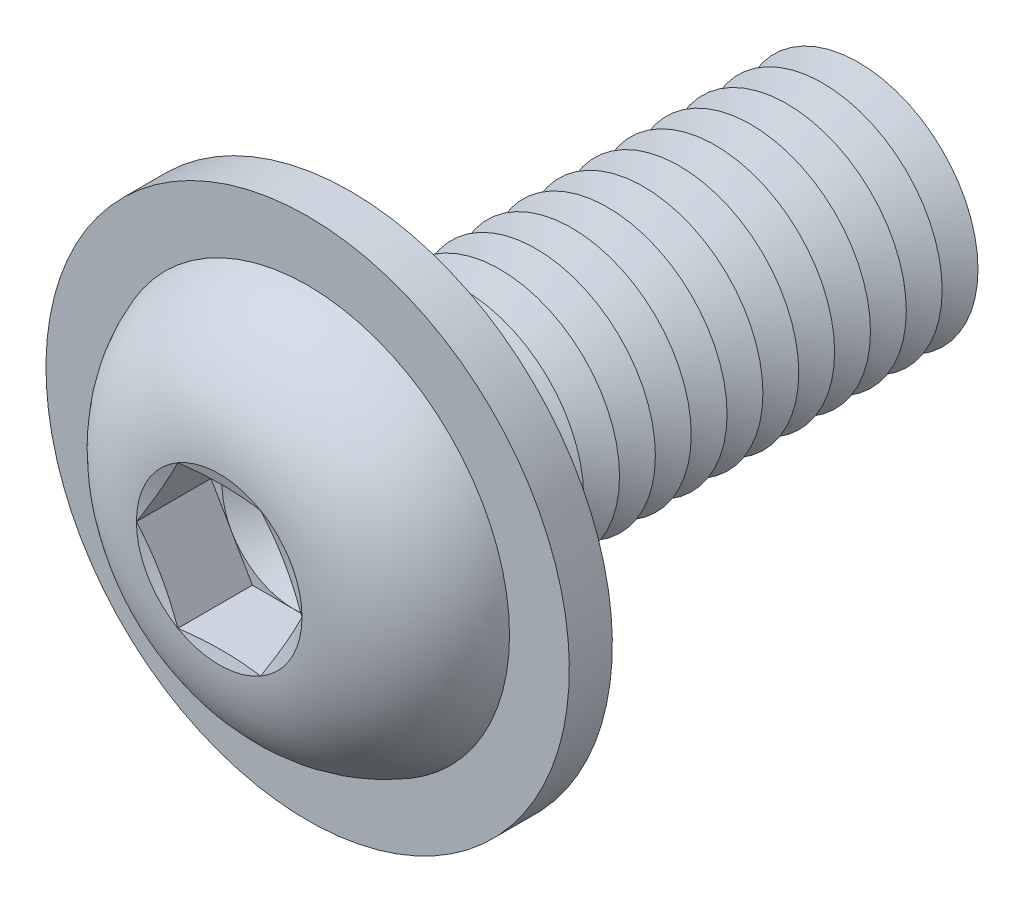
from build123d import *

# Parameters (mm, degrees)
FILLET1_R           = 0.75
LPATTERN1_COUNT     = 14
LPATTERN1_PITCH     = 1.5
CUT_EXTRUDE1_DEPTH  = 3.12
SKETCH5_R           = 10.95
SKETCH5_R_2         = 5.75
BOSS_EXTRUDE1_DEPTH = 1.8


with BuildPart() as part:
    # Sketch1 → Revolve1 (revolve)
    with BuildSketch(Plane(origin=(0, 0, 0), x_dir=(0, 0, -1), z_dir=(1, 0, 0)), mode=Mode.PRIVATE) as revolve1_sk:
        with BuildLine():
            Line((0, 5), (0, 8.75))
            ThreePointArc((0, 8.75), (-3.814142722, 7.21429474), (-5.5, 3.4641))
            Line((-5.5, 3.4641), (-5.035898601, 1.73205))
            Line((-5.035898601, 1.73205), (-5.5, 1.73205))
            Line((-5.5, 1.73205), (-5.5, 0))
            Line((-5.5, 0), (22, 0))
            Line((22, 0), (22, 5))
            Line((22, 5), (0, 5))
        make_face()
    revolve(revolve1_sk.sketch.rotate(Axis((0, 0, -22), (0, 0, 1)), 90), axis=Axis((0, 0, -22), (0, 0, 1)))

    # Fillet1
    fillet1_edges = [part.edges().sort_by_distance(p)[0] for p in [
        (5, 0, 0),
    ]]
    fillet(fillet1_edges, radius=FILLET1_R)

    # Sketch2 → Cut-Revolve1 (revolve, cut)
    with BuildSketch(Plane(origin=(0, 0, 0), x_dir=(0, 0, -1), z_dir=(1, 0, 0)), mode=Mode.PRIVATE) as cut_revolve1_sk:
        Polygon((21.25, 5), (22.75, 5), (22, 3.700961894), align=None)
    cut_revolve1 = revolve(cut_revolve1_sk.sketch.rotate(Axis((0, 0, -22), (0, 0, -1)), 270), axis=Axis((0, 0, -22), (0, 0, -1)), mode=Mode.SUBTRACT)

    # LPattern1: Cut-Revolve1 ×14
    with Locations(*[(0, 0, i * LPATTERN1_PITCH) for i in range(1, LPATTERN1_COUNT)]):
        add(cut_revolve1, mode=Mode.SUBTRACT)

    # Sketch3 → Cut-Extrude1 (cut)
    with BuildSketch(Plane.XY.offset(5.5)):
        Polygon((1.73205, 2.999998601), (-1.73205, 2.999998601), (-3.4641, 0), (-1.73205, -2.999998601), (1.73205, -2.999998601), (3.4641, 0), align=None)
    extrude(amount=-CUT_EXTRUDE1_DEPTH, mode=Mode.SUBTRACT)

    # Cut-Extrude2 cone 1 section (on through the dimple's axis) → Cut-Extrude2 (revolve, cut)
    with BuildSketch(Plane(origin=(0, 0, 2.38), x_dir=(0, -1, 0), z_dir=(1, 0, 0))):
        Polygon((0, 0), (2.999998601, 0), (0, 1.73205), align=None)
    revolve(axis=Axis((0, 0, 2.38), (0, 0, -1)), mode=Mode.SUBTRACT)

    # Sketch5 → Boss-Extrude1 (add)
    with BuildSketch(Plane(origin=(0, 0, 0), x_dir=(-1, 0, 0), z_dir=(0, 0, -1))):
        with Locations(Location((0, 0, 0), (0, 0, 90))):
            Circle(SKETCH5_R)
        Circle(SKETCH5_R_2, mode=Mode.SUBTRACT)
    extrude(amount=-BOSS_EXTRUDE1_DEPTH)


solid = part.part
